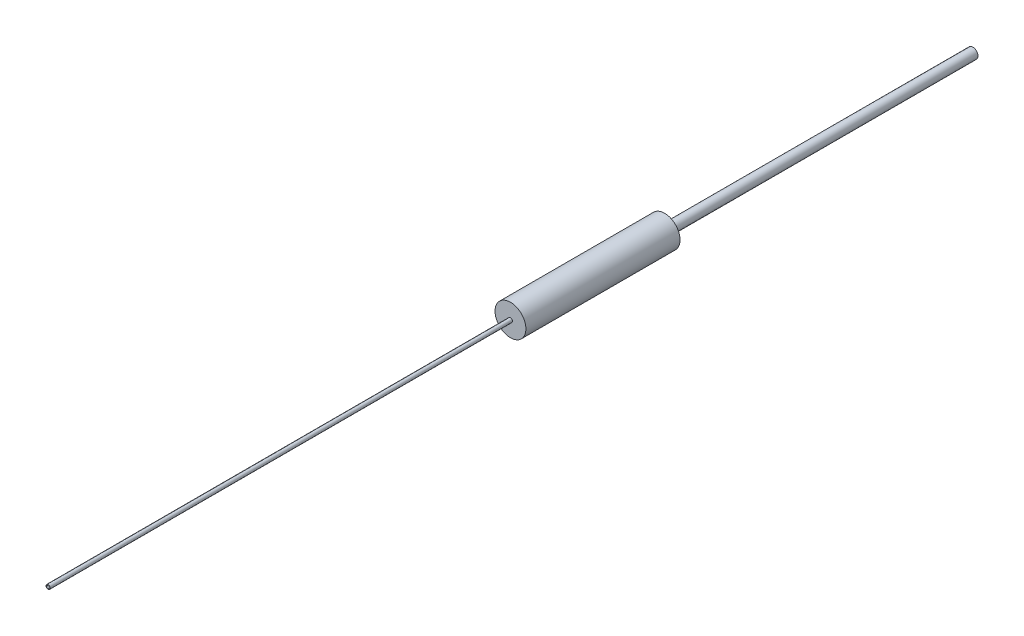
ISO-10303-21;
HEADER;
FILE_DESCRIPTION(('STEP AP214'),'2;1');
FILE_NAME('part.step','',(''),(''),'','','');
FILE_SCHEMA(('AUTOMOTIVE_DESIGN { 1 0 10303 214 1 1 1 1 }'));
ENDSEC;
DATA;
#1=APPLICATION_CONTEXT('core data for automotive mechanical design processes');
#2=APPLICATION_PROTOCOL_DEFINITION('international standard','automotive_design',2000,#1);
#3=PRODUCT_CONTEXT('',#1,'mechanical');
#4=PRODUCT('Part','Part','',(#3));
#5=PRODUCT_RELATED_PRODUCT_CATEGORY('part','',(#4));
#6=PRODUCT_DEFINITION_FORMATION('','',#4);
#7=PRODUCT_DEFINITION_CONTEXT('part definition',#1,'design');
#8=PRODUCT_DEFINITION('design','',#6,#7);
#9=PRODUCT_DEFINITION_SHAPE('','',#8);
#10=(LENGTH_UNIT() NAMED_UNIT(*) SI_UNIT(.MILLI.,.METRE.));
#11=(NAMED_UNIT(*) PLANE_ANGLE_UNIT() SI_UNIT($,.RADIAN.));
#12=(NAMED_UNIT(*) SI_UNIT($,.STERADIAN.) SOLID_ANGLE_UNIT());
#13=UNCERTAINTY_MEASURE_WITH_UNIT(LENGTH_MEASURE(1.E-05),#10,'distance_accuracy_value','');
#14=(GEOMETRIC_REPRESENTATION_CONTEXT(3) GLOBAL_UNCERTAINTY_ASSIGNED_CONTEXT((#13)) GLOBAL_UNIT_ASSIGNED_CONTEXT((#10,
#11,#12)) REPRESENTATION_CONTEXT('',''));
#15=CARTESIAN_POINT('',(0.,0.,0.));
#16=DIRECTION('',(0.,0.,1.));
#17=DIRECTION('',(1.,0.,0.));
#18=AXIS2_PLACEMENT_3D('',#15,#16,#17);
#19=CARTESIAN_POINT('',(0.,0.,-15.));
#20=DIRECTION('',(0.,0.,1.));
#21=DIRECTION('',(1.,0.,0.));
#22=AXIS2_PLACEMENT_3D('',#19,#20,#21);
#23=CYLINDRICAL_SURFACE('',#22,1.5);
#24=CARTESIAN_POINT('',(0.,0.,-15.));
#25=DIRECTION('',(0.,0.,1.));
#26=DIRECTION('',(1.,0.,0.));
#27=AXIS2_PLACEMENT_3D('',#24,#25,#26);
#28=CIRCLE('',#27,1.5);
#29=CARTESIAN_POINT('',(1.5,0.,-15.));
#30=VERTEX_POINT('',#29);
#31=EDGE_CURVE('E44',#30,#30,#28,.T.);
#32=ORIENTED_EDGE('',*,*,#31,.T.);
#33=EDGE_LOOP('',(#32));
#34=FACE_BOUND('',#33,.T.);
#35=CARTESIAN_POINT('',(0.,0.,0.));
#36=DIRECTION('',(0.,0.,1.));
#37=DIRECTION('',(1.,0.,0.));
#38=AXIS2_PLACEMENT_3D('',#35,#36,#37);
#39=CIRCLE('',#38,1.5);
#40=CARTESIAN_POINT('',(1.5,0.,0.));
#41=VERTEX_POINT('',#40);
#42=EDGE_CURVE('E40',#41,#41,#39,.T.);
#43=ORIENTED_EDGE('',*,*,#42,.F.);
#44=EDGE_LOOP('',(#43));
#45=FACE_BOUND('',#44,.T.);
#46=ADVANCED_FACE('F37',(#34,#45),#23,.T.);
#47=CARTESIAN_POINT('',(0.,0.,-15.));
#48=DIRECTION('',(0.,0.,1.));
#49=DIRECTION('',(1.,0.,0.));
#50=AXIS2_PLACEMENT_3D('',#47,#48,#49);
#51=PLANE('',#50);
#52=CARTESIAN_POINT('',(0.,0.,-15.));
#53=DIRECTION('',(0.,0.,-1.));
#54=DIRECTION('',(-1.,0.,0.));
#55=AXIS2_PLACEMENT_3D('',#52,#53,#54);
#56=CIRCLE('',#55,0.5);
#57=CARTESIAN_POINT('',(-0.5,0.,-15.));
#58=VERTEX_POINT('',#57);
#59=EDGE_CURVE('E10',#58,#58,#56,.T.);
#60=ORIENTED_EDGE('',*,*,#59,.F.);
#61=EDGE_LOOP('',(#60));
#62=FACE_BOUND('',#61,.T.);
#63=ORIENTED_EDGE('',*,*,#31,.F.);
#64=EDGE_LOOP('',(#63));
#65=FACE_BOUND('',#64,.T.);
#66=ADVANCED_FACE('F95',(#62,#65),#51,.F.);
#67=CARTESIAN_POINT('',(0.,0.,0.));
#68=DIRECTION('',(0.,0.,1.));
#69=DIRECTION('',(1.,0.,0.));
#70=AXIS2_PLACEMENT_3D('',#67,#68,#69);
#71=PLANE('',#70);
#72=CARTESIAN_POINT('',(0.,0.,0.));
#73=DIRECTION('',(0.,0.,1.));
#74=DIRECTION('',(1.,0.,0.));
#75=AXIS2_PLACEMENT_3D('',#72,#73,#74);
#76=CIRCLE('',#75,0.2);
#77=CARTESIAN_POINT('',(0.2,0.,0.));
#78=VERTEX_POINT('',#77);
#79=EDGE_CURVE('E56',#78,#78,#76,.T.);
#80=ORIENTED_EDGE('',*,*,#79,.F.);
#81=EDGE_LOOP('',(#80));
#82=FACE_BOUND('',#81,.T.);
#83=ORIENTED_EDGE('',*,*,#42,.T.);
#84=EDGE_LOOP('',(#83));
#85=FACE_BOUND('',#84,.T.);
#86=ADVANCED_FACE('F100',(#82,#85),#71,.T.);
#87=CARTESIAN_POINT('',(0.,0.,45.));
#88=DIRECTION('',(0.,0.,-1.));
#89=DIRECTION('',(-1.,0.,0.));
#90=AXIS2_PLACEMENT_3D('',#87,#88,#89);
#91=CYLINDRICAL_SURFACE('',#90,0.2);
#92=CARTESIAN_POINT('',(0.,0.,45.));
#93=DIRECTION('',(0.,0.,1.));
#94=DIRECTION('',(1.,0.,0.));
#95=AXIS2_PLACEMENT_3D('',#92,#93,#94);
#96=CIRCLE('',#95,0.2);
#97=CARTESIAN_POINT('',(0.2,0.,45.));
#98=VERTEX_POINT('',#97);
#99=EDGE_CURVE('E53',#98,#98,#96,.T.);
#100=ORIENTED_EDGE('',*,*,#99,.F.);
#101=EDGE_LOOP('',(#100));
#102=FACE_BOUND('',#101,.T.);
#103=ORIENTED_EDGE('',*,*,#79,.T.);
#104=EDGE_LOOP('',(#103));
#105=FACE_BOUND('',#104,.T.);
#106=ADVANCED_FACE('F109',(#102,#105),#91,.T.);
#107=CARTESIAN_POINT('',(0.,0.,45.));
#108=DIRECTION('',(0.,0.,1.));
#109=DIRECTION('',(1.,0.,0.));
#110=AXIS2_PLACEMENT_3D('',#107,#108,#109);
#111=PLANE('',#110);
#112=CARTESIAN_POINT('',(0.,0.,45.));
#113=DIRECTION('',(0.,0.,1.));
#114=DIRECTION('',(1.,0.,0.));
#115=AXIS2_PLACEMENT_3D('',#112,#113,#114);
#116=CIRCLE('',#115,0.1375);
#117=CARTESIAN_POINT('',(0.1375,0.,45.));
#118=VERTEX_POINT('',#117);
#119=EDGE_CURVE('E65',#118,#118,#116,.T.);
#120=ORIENTED_EDGE('',*,*,#119,.F.);
#121=EDGE_LOOP('',(#120));
#122=FACE_BOUND('',#121,.T.);
#123=ORIENTED_EDGE('',*,*,#99,.T.);
#124=EDGE_LOOP('',(#123));
#125=FACE_BOUND('',#124,.T.);
#126=ADVANCED_FACE('F114',(#122,#125),#111,.T.);
#127=CARTESIAN_POINT('',(0.,0.,-45.));
#128=DIRECTION('',(0.,0.,1.));
#129=DIRECTION('',(1.,0.,0.));
#130=AXIS2_PLACEMENT_3D('',#127,#128,#129);
#131=CYLINDRICAL_SURFACE('',#130,0.5);
#132=CARTESIAN_POINT('',(0.,0.,-45.));
#133=DIRECTION('',(0.,0.,-1.));
#134=DIRECTION('',(-1.,0.,0.));
#135=AXIS2_PLACEMENT_3D('',#132,#133,#134);
#136=CIRCLE('',#135,0.5);
#137=CARTESIAN_POINT('',(-0.5,0.,-45.));
#138=VERTEX_POINT('',#137);
#139=EDGE_CURVE('E51',#138,#138,#136,.T.);
#140=ORIENTED_EDGE('',*,*,#139,.F.);
#141=EDGE_LOOP('',(#140));
#142=FACE_BOUND('',#141,.T.);
#143=ORIENTED_EDGE('',*,*,#59,.T.);
#144=EDGE_LOOP('',(#143));
#145=FACE_BOUND('',#144,.T.);
#146=ADVANCED_FACE('F120',(#142,#145),#131,.T.);
#147=CARTESIAN_POINT('',(0.,0.,-45.));
#148=DIRECTION('',(0.,0.,-1.));
#149=DIRECTION('',(-1.,0.,0.));
#150=AXIS2_PLACEMENT_3D('',#147,#148,#149);
#151=PLANE('',#150);
#152=ORIENTED_EDGE('',*,*,#139,.T.);
#153=EDGE_LOOP('',(#152));
#154=FACE_BOUND('',#153,.T.);
#155=ADVANCED_FACE('F91',(#154),#151,.T.);
#156=CARTESIAN_POINT('',(0.,0.,44.9));
#157=DIRECTION('',(0.,0.,1.));
#158=DIRECTION('',(1.,0.,0.));
#159=AXIS2_PLACEMENT_3D('',#156,#157,#158);
#160=CYLINDRICAL_SURFACE('',#159,0.1375);
#161=CARTESIAN_POINT('',(0.,0.,44.9));
#162=DIRECTION('',(0.,0.,1.));
#163=DIRECTION('',(1.,0.,0.));
#164=AXIS2_PLACEMENT_3D('',#161,#162,#163);
#165=CIRCLE('',#164,0.1375);
#166=CARTESIAN_POINT('',(0.1375,0.,44.9));
#167=VERTEX_POINT('',#166);
#168=EDGE_CURVE('E61',#167,#167,#165,.T.);
#169=ORIENTED_EDGE('',*,*,#168,.F.);
#170=EDGE_LOOP('',(#169));
#171=FACE_BOUND('',#170,.T.);
#172=ORIENTED_EDGE('',*,*,#119,.T.);
#173=EDGE_LOOP('',(#172));
#174=FACE_BOUND('',#173,.T.);
#175=ADVANCED_FACE('F83',(#171,#174),#160,.F.);
#176=CARTESIAN_POINT('',(0.,0.,44.9));
#177=DIRECTION('',(0.,0.,1.));
#178=DIRECTION('',(1.,0.,0.));
#179=AXIS2_PLACEMENT_3D('',#176,#177,#178);
#180=PLANE('',#179);
#181=CARTESIAN_POINT('',(0.,0.,44.9));
#182=DIRECTION('',(0.,0.,1.));
#183=DIRECTION('',(1.,0.,0.));
#184=AXIS2_PLACEMENT_3D('',#181,#182,#183);
#185=CIRCLE('',#184,0.1325);
#186=CARTESIAN_POINT('',(0.1325,0.,44.9));
#187=VERTEX_POINT('',#186);
#188=EDGE_CURVE('E70',#187,#187,#185,.T.);
#189=ORIENTED_EDGE('',*,*,#188,.F.);
#190=EDGE_LOOP('',(#189));
#191=FACE_BOUND('',#190,.T.);
#192=ORIENTED_EDGE('',*,*,#168,.T.);
#193=EDGE_LOOP('',(#192));
#194=FACE_BOUND('',#193,.T.);
#195=ADVANCED_FACE('F81',(#191,#194),#180,.T.);
#196=CARTESIAN_POINT('',(0.,0.,44.9));
#197=DIRECTION('',(0.,0.,1.));
#198=DIRECTION('',(1.,0.,0.));
#199=AXIS2_PLACEMENT_3D('',#196,#197,#198);
#200=CYLINDRICAL_SURFACE('',#199,0.1325);
#201=ORIENTED_EDGE('',*,*,#188,.T.);
#202=EDGE_LOOP('',(#201));
#203=FACE_BOUND('',#202,.T.);
#204=CARTESIAN_POINT('',(0.,0.,45.));
#205=DIRECTION('',(0.,0.,1.));
#206=DIRECTION('',(1.,0.,0.));
#207=AXIS2_PLACEMENT_3D('',#204,#205,#206);
#208=CIRCLE('',#207,0.1325);
#209=CARTESIAN_POINT('',(0.1325,0.,45.));
#210=VERTEX_POINT('',#209);
#211=EDGE_CURVE('E72',#210,#210,#208,.T.);
#212=ORIENTED_EDGE('',*,*,#211,.F.);
#213=EDGE_LOOP('',(#212));
#214=FACE_BOUND('',#213,.T.);
#215=ADVANCED_FACE('F78',(#203,#214),#200,.T.);
#216=ORIENTED_EDGE('',*,*,#211,.T.);
#217=EDGE_LOOP('',(#216));
#218=FACE_BOUND('',#217,.T.);
#219=ADVANCED_FACE('F89',(#218),#111,.T.);
#220=CLOSED_SHELL('',(#46,#66,#86,#106,#126,#146,#155,#175,#195,#215,#219));
#221=MANIFOLD_SOLID_BREP('B2',#220);
#222=ADVANCED_BREP_SHAPE_REPRESENTATION('',(#18,#221),#14);
#223=SHAPE_DEFINITION_REPRESENTATION(#9,#222);
ENDSEC;
END-ISO-10303-21;
